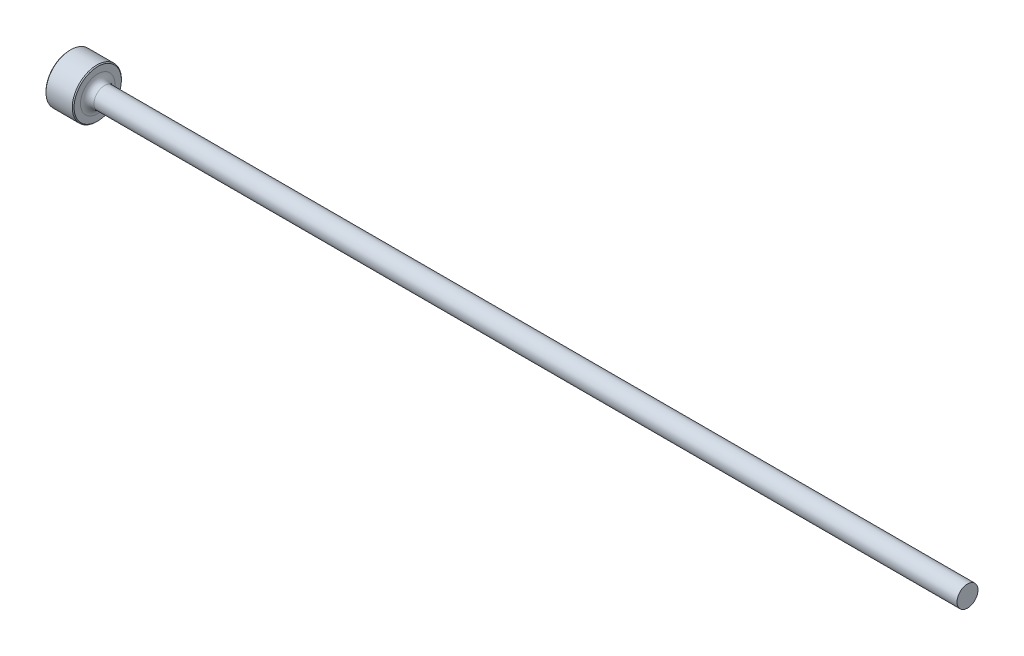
from build123d import *

# Parameters (mm, degrees)
CHAMFER1_SIZE = 0.1016


with BuildPart() as part:
    # Sketch1 → Revolve1 (revolve)
    with BuildSketch(Plane.XY):
        with BuildLine():
            Line((0, 0), (0, 2.778125))
            Line((0, 2.778125), (3.175, 2.778125))
            Line((3.175, 2.778125), (3.175, 1.948815))
            ThreePointArc((3.175, 1.948815), (3.398184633, 1.409999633), (3.937, 1.186815))
            Line((3.937, 1.186815), (101.6, 1.186815))
            Line((101.6, 1.186815), (101.6, 0))
            Line((101.6, 0), (0, 0))
        make_face()
    revolve(axis=Axis((101.6, 0, 0), (-1, 0, 0)))

    # Chamfer1
    chamfer1_edges = [part.edges().sort_by_distance(p)[0] for p in [
        (0, -2.778125, 0),
        (3.175, -2.778125, 0),
    ]]
    chamfer(chamfer1_edges, length=CHAMFER1_SIZE)


solid = part.part
